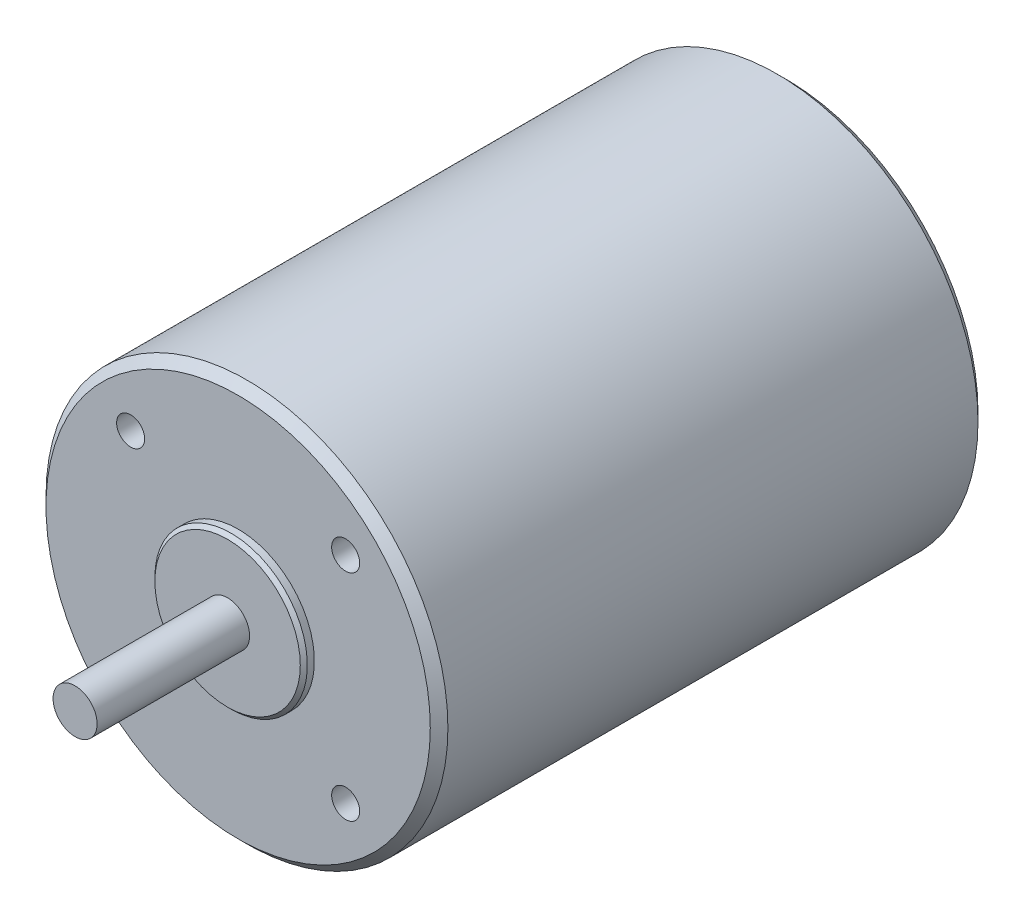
from build123d import *

# Parameters (mm, degrees)
SKETCH1_R                  = 28.956
BASE_EXTRUDE_DEPTH         = 78.9178
SKETCH2_R                  = 3.175
BOSS_EXTRUDE1_DEPTH        = 23.495
SKETCH3_R                  = 10.9855
BOSS_EXTRUDE2_DEPTH        = 1.524
CHAMFER1_SIZE              = 0.508
CHAMFER2_SIZE              = 1.27
F_10_32_TAPPED_HOLE1_D     = 4.0386
F_10_32_TAPPED_HOLE1_DEPTH = 13.6144
F_10_32_TAPPED_HOLE1_TIP   = 1.213317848


with BuildPart() as part:
    # Sketch1 → Base-Extrude (new body)
    with BuildSketch(Plane.XY):
        Circle(SKETCH1_R)
    extrude(amount=BASE_EXTRUDE_DEPTH)

    # Sketch2 → Boss-Extrude1 (add)
    with BuildSketch(Plane.XY.offset(78.9178)):
        Circle(SKETCH2_R)
    extrude(amount=BOSS_EXTRUDE1_DEPTH)

    # Sketch3 → Boss-Extrude2 (add)
    with BuildSketch(Plane.XY.offset(78.9178)):
        with Locations(Location((0, 0, 0), (0, 0, 180))):
            Circle(SKETCH3_R)
    extrude(amount=BOSS_EXTRUDE2_DEPTH)

    # Chamfer1
    chamfer1_edges = [part.edges().sort_by_distance(p)[0] for p in [
        (10.9855, 0, 80.4418),
    ]]
    chamfer(chamfer1_edges, length=CHAMFER1_SIZE)

    # Chamfer2
    chamfer2_edges = [part.edges().sort_by_distance(p)[0] for p in [
        (-28.956, 0, 0),
        (-28.956, 0, 78.9178),
    ]]
    chamfer(chamfer2_edges, length=CHAMFER2_SIZE)

    # 10-32 Tapped Hole1
    with Locations(Plane.XY.offset(78.9178)):
        with Locations((15.490941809, 15.490941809), (15.490941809, -15.490941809), (-15.490941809, -15.490941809), (-15.490941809, 15.490941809)):
            Hole(F_10_32_TAPPED_HOLE1_D / 2, depth=F_10_32_TAPPED_HOLE1_DEPTH)
            with Locations((0, 0, -(F_10_32_TAPPED_HOLE1_DEPTH + F_10_32_TAPPED_HOLE1_TIP / 2))):  # 118° drill point
                Cone(0, F_10_32_TAPPED_HOLE1_D / 2, F_10_32_TAPPED_HOLE1_TIP, mode=Mode.SUBTRACT)


solid = part.part
